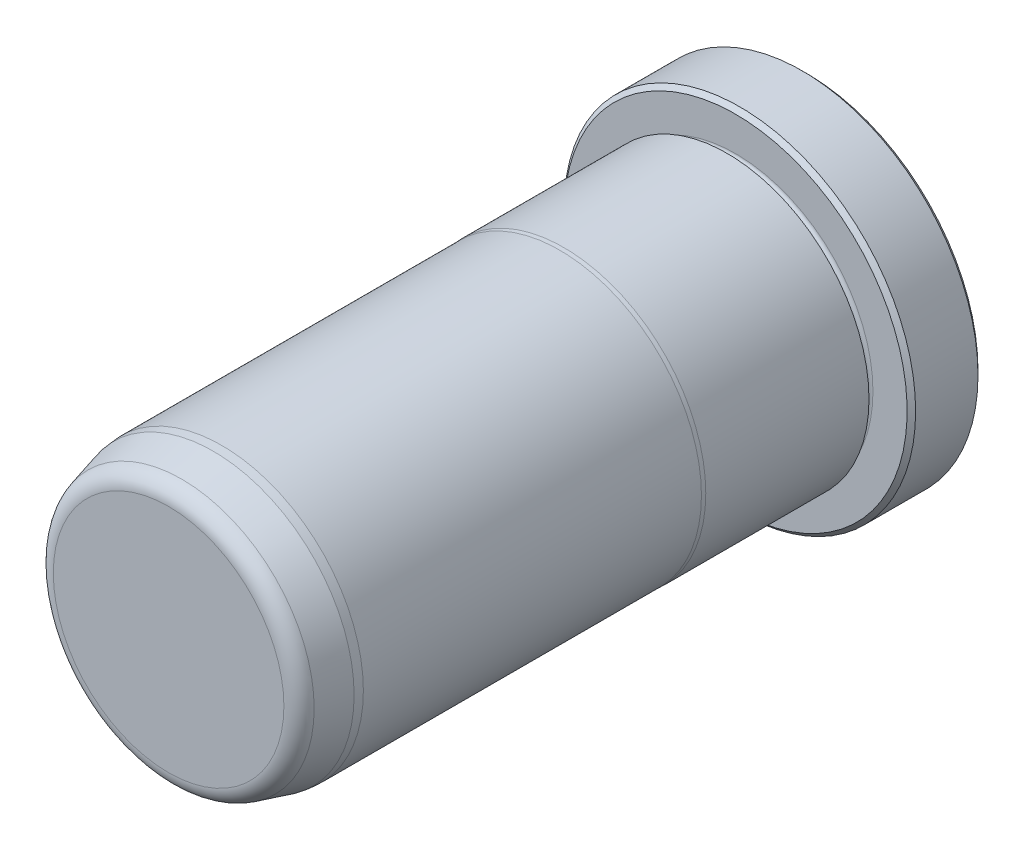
from build123d import *

# Parameters (mm, degrees)
FILLET6_R     = 1.5875
CHAMFER1_SIZE = 0.381


with BuildPart() as part:
    # Sketch1 → Revolve1 (revolve)
    with BuildSketch(Plane(origin=(0, 0, 0), x_dir=(0, 0, -1), z_dir=(1, 0, 0)), mode=Mode.PRIVATE) as revolve1_sk:
        with BuildLine():
            Line((0, 0), (0, 15.748))
            Line((0, 15.748), (-6.35, 15.748))
            Line((-6.35, 15.748), (-6.35, 12.3063))
            ThreePointArc((-6.35, 12.3063), (-6.731, 11.9253), (-7.112, 12.3063))
            Line((-7.112, 12.3063), (-7.112, 12.7127))
            Line((-7.112, 12.7127), (-21.734763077, 12.7127))
            Line((-21.734763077, 12.7127), (-22.098, 12.6873))
            Line((-22.098, 12.6873), (-52.3875, 12.6873))
            Line((-52.3875, 12.6873), (-53.1495, 12.620633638))
            Line((-53.1495, 12.620633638), (-57.15, 11.548702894))
            Line((-57.15, 11.548702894), (-57.15, 0))
            Line((-57.15, 0), (0, 0))
        make_face()
    revolve(revolve1_sk.sketch.rotate(Axis((0, 0, 0), (0, 0, -1)), 90), axis=Axis((0, 0, 0), (0, 0, -1)))

    # Fillet6
    fillet6_edges = [part.edges().sort_by_distance(p)[0] for p in [
        (-11.548702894, 0, 57.15),
    ]]
    fillet(fillet6_edges, radius=FILLET6_R)

    # Chamfer1
    chamfer1_edges = [part.edges().sort_by_distance(p)[0] for p in [
        (-15.748, 0, 6.35),
        (-15.748, 0, 0),
    ]]
    chamfer(chamfer1_edges, length=CHAMFER1_SIZE)


solid = part.part
